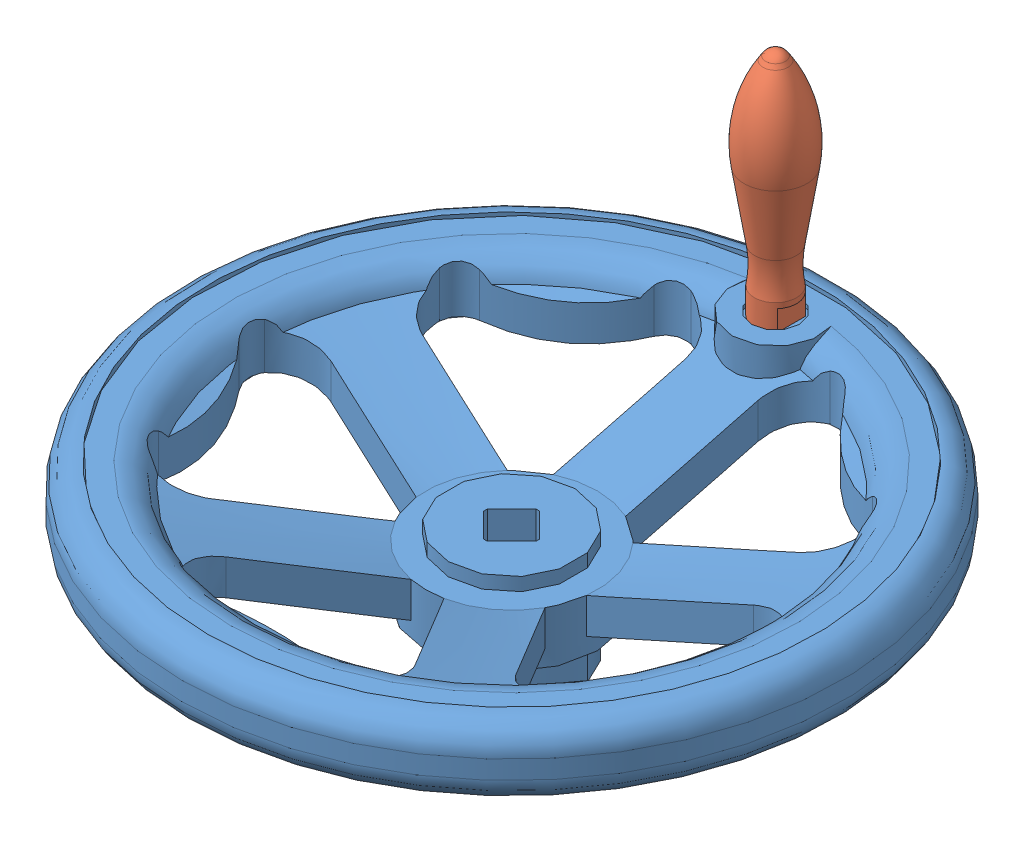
SolidWorks assembly Handle With Square Key Asy, Misumi.sldasm, configuration Default (file format 5000). Lengths in mm.
Overall size (250 150.15 250).
2 component instances, 2 part files, 0 mates.
Components (placement in the parent):
- AHLNK250-SC15_h-1: AHLNK250-SC15_h.sldprt [Default] at origin size (250 65.5 250)
- GRMK25--1: GRMK25-.sldprt [Default] at (0 62.85 -100) x (0 1 0) z (-1 0 0) size (105.3 25 25)
